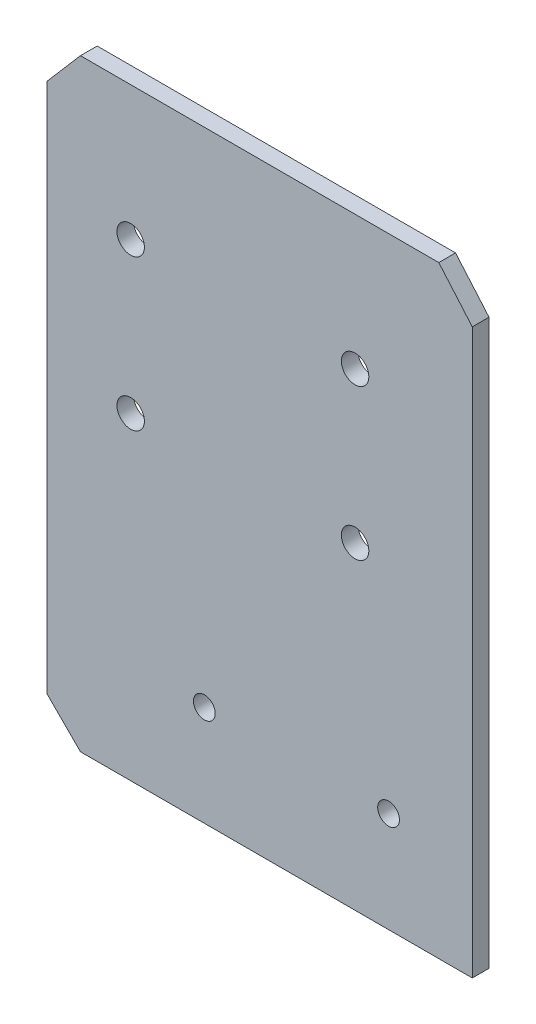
from build123d import *

# Parameters (mm, degrees)
ESQUISSE1_R      = 4.1
ESQUISSE1_R_2    = 3.25
EXTRUSION1_DEPTH = 5


with BuildPart() as part:
    # Esquisse1 → Extrusion1 (new body)
    with BuildSketch(Plane.XY):
        Polygon((-19.2542, -3.25997037), (-19.2542, 165.11502963), (-29.2542, 176.74002963), (-136.2542, 176.74002963), (-146.2542, 165.11502963), (-146.2542, 6.74002963), (-136.2542, -3.25997037), align=None)
        with Locations((-121.2542, 136.74002963)):
            Circle(ESQUISSE1_R, mode=Mode.SUBTRACT)
        with Locations((-54.2542, 136.74002963)):
            Circle(ESQUISSE1_R, mode=Mode.SUBTRACT)
        with Locations((-54.2542, 91.74002963)):
            Circle(ESQUISSE1_R, mode=Mode.SUBTRACT)
        with Locations((-121.2542, 91.74002963)):
            Circle(ESQUISSE1_R, mode=Mode.SUBTRACT)
        with Locations((-99.2542, 26.74002963)):
            Circle(ESQUISSE1_R_2, mode=Mode.SUBTRACT)
        with Locations((-44.2542, 26.74002963)):
            Circle(ESQUISSE1_R_2, mode=Mode.SUBTRACT)
    extrude(amount=EXTRUSION1_DEPTH)


solid = part.part
